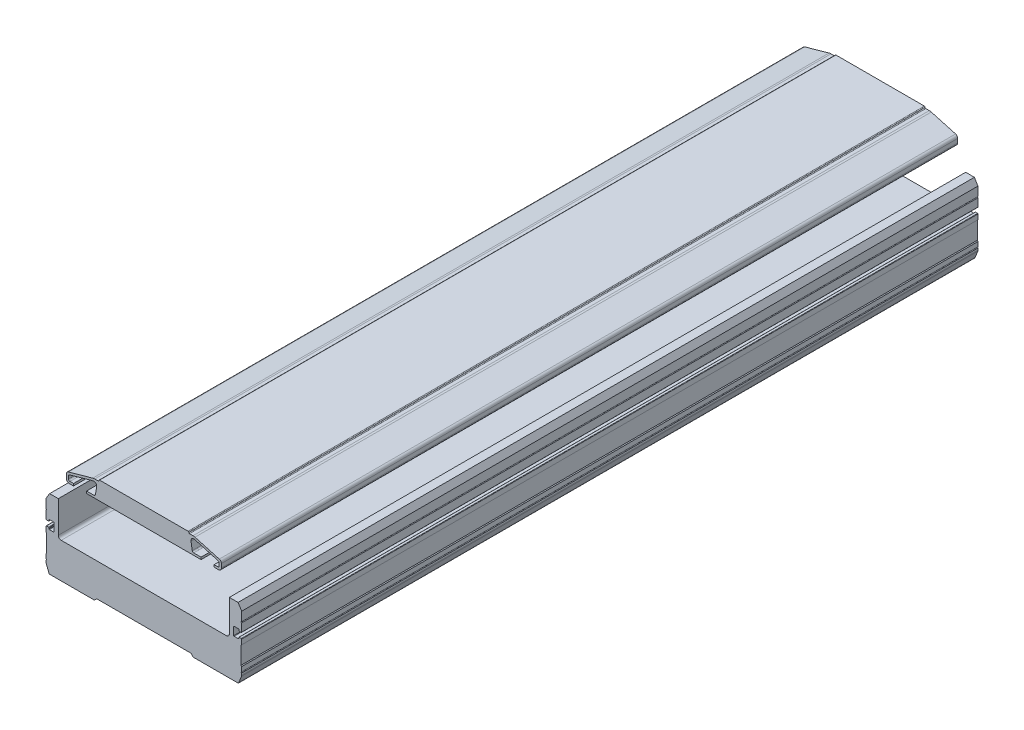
from build123d import *

# Parameters (mm, degrees)
EXTRUDE_1_DEPTH             = 508
EXTRUDE_1_2_DEPTH           = 508
HOLE_WIZARD_1_AT_2_COUNT    = 2
HOLE_WIZARD_1_AT_2_PITCH    = 200
HOLE_WIZARD_1_AT_3_COUNT    = 2
HOLE_WIZARD_1_AT_3_PITCH    = 400
HOLE_WIZARD_1_AT_4_COUNT    = 2
HOLE_WIZARD_1_AT_4_PITCH    = 413.806718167
HOLE_WIZARD_1_AT_5_COUNT    = 2
HOLE_WIZARD_1_AT_5_PITCH    = 226.353705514
HOLE_WIZARD_1_AT_6_COUNT    = 2
HOLE_WIZARD_1_AT_6_PITCH    = 106
HOLE_WIZARD_M6_1_AT_2_COUNT = 2
HOLE_WIZARD_M6_1_AT_2_PITCH = 106
HOLE_WIZARD_M6_1_AT_3_COUNT = 2
HOLE_WIZARD_M6_1_AT_3_PITCH = 200
HOLE_WIZARD_M6_1_AT_4_COUNT = 2
HOLE_WIZARD_M6_1_AT_4_PITCH = 400
HOLE_WIZARD_M6_1_AT_5_COUNT = 2
HOLE_WIZARD_M6_1_AT_5_PITCH = 413.806718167
HOLE_WIZARD_M6_1_AT_6_COUNT = 2
HOLE_WIZARD_M6_1_AT_6_PITCH = 226.353705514


with BuildPart() as part:
    # Sketch 1 → Extrude 1 (new body)
    with BuildSketch(Plane.XY):
        with BuildLine():
            Line((-51.499999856, 59.400000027), (-48.499999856, 59.400000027))
            Line((-48.499999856, 59.400000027), (-48.499999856, 60.900000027))
            Line((-48.499999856, 60.900000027), (-50.999999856, 60.900000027))
            ThreePointArc((-50.999999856, 60.900000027), (-51.707106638, 61.192893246), (-51.999999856, 61.900000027))
            Line((-51.999999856, 61.900000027), (-51.999999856, 63.704621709))
            ThreePointArc((-51.999999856, 63.704621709), (-51.796871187, 64.308770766), (-51.27000769, 64.667479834))
            Line((-51.27000769, 64.667479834), (-35.04852954, 69.21635995))
            ThreePointArc((-35.04852954, 69.21635995), (-33.17193273, 68.778444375), (-32.536146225, 66.959334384))
            Line((-32.536146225, 66.959334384), (-33.413816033, 61.73434537))
            ThreePointArc((-33.413816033, 61.73434537), (-33.754110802, 61.136568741), (-34.399999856, 60.900000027))
            Line((-34.399999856, 60.900000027), (-39.499999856, 60.900000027))
            Line((-39.499999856, 60.900000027), (-39.499999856, 59.400000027))
            Line((-39.499999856, 59.400000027), (39.500000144, 59.400000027))
            Line((39.500000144, 59.400000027), (39.500000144, 60.900000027))
            Line((39.500000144, 60.900000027), (34.400000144, 60.900000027))
            ThreePointArc((34.400000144, 60.900000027), (33.754111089, 61.136568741), (33.41381632, 61.73434537))
            Line((33.41381632, 61.73434537), (32.536146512, 66.959334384))
            ThreePointArc((32.536146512, 66.959334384), (33.171933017, 68.778444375), (35.048529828, 69.21635995))
            Line((35.048529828, 69.21635995), (51.270007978, 64.667479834))
            ThreePointArc((51.270007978, 64.667479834), (51.796871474, 64.308770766), (52.000000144, 63.704621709))
            Line((52.000000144, 63.704621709), (52.000000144, 61.900000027))
            ThreePointArc((52.000000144, 61.900000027), (51.707106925, 61.192893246), (51.000000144, 60.900000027))
            Line((51.000000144, 60.900000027), (48.500000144, 60.900000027))
            Line((48.500000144, 60.900000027), (48.500000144, 59.400000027))
            Line((48.500000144, 59.400000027), (51.500000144, 59.400000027))
            ThreePointArc((51.500000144, 59.400000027), (52.914213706, 59.985786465), (53.500000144, 61.400000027))
            Line((53.500000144, 61.400000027), (53.500000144, 64.083697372))
            ThreePointArc((53.500000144, 64.083697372), (53.093742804, 65.291995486), (52.040015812, 66.009413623))
            Line((52.040015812, 66.009413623), (35.262246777, 70.714290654))
            ThreePointArc((35.262246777, 70.714290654), (34.593583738, 70.853355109), (33.912207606, 70.900000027))
            Line((33.912207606, 70.900000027), (31.500000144, 70.900000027))
            ThreePointArc((31.500000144, 70.900000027), (31.146446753, 71.046446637), (31.000000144, 71.400000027))
            ThreePointArc((31.000000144, 71.400000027), (30.853553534, 71.753553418), (30.500000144, 71.900000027))
            Line((30.500000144, 71.900000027), (-30.499999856, 71.900000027))
            ThreePointArc((-30.499999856, 71.900000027), (-30.853553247, 71.753553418), (-30.999999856, 71.400000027))
            ThreePointArc((-30.999999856, 71.400000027), (-31.146446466, 71.046446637), (-31.499999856, 70.900000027))
            Line((-31.499999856, 70.900000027), (-33.912207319, 70.900000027))
            ThreePointArc((-33.912207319, 70.900000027), (-34.593583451, 70.853355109), (-35.262246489, 70.714290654))
            Line((-35.262246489, 70.714290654), (-52.040015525, 66.009413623))
            ThreePointArc((-52.040015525, 66.009413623), (-53.093742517, 65.291995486), (-53.499999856, 64.083697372))
            Line((-53.499999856, 64.083697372), (-53.499999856, 61.400000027))
            ThreePointArc((-53.499999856, 61.400000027), (-52.914213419, 59.985786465), (-51.499999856, 59.400000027))
        make_face()
    extrude(amount=EXTRUDE_1_DEPTH)


with BuildPart() as body_2:
    # Sketch 1 → Extrude 1 2 (new body)
    with BuildSketch(Plane.XY):
        with BuildLine():
            Line((-65.16, -1.6), (-34.1, -1.6))
            Line((-34.1, -1.6), (-32.5, 0))
            Line((-32.5, 0), (32.5, 0))
            Line((32.5, 0), (34.1, -1.6))
            Line((34.1, -1.6), (65.16, -1.6))
            ThreePointArc((65.16, -1.6), (65.35722349, -1.328991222), (65.506419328, -1.028852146))
            Line((65.506419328, -1.028852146), (67.359978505, 3.646795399))
            ThreePointArc((67.359978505, 3.646795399), (67.464610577, 4.00739535), (67.499999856, 4.381197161))
            Line((67.499999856, 4.381197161), (67.499999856, 5.625000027))
            ThreePointArc((67.499999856, 5.625000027), (67.124999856, 6.000000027), (67.499999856, 6.375000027))
            Line((67.499999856, 6.375000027), (67.499999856, 9.500000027))
            Line((67.499999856, 9.500000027), (66.999999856, 10.000000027))
            Line((66.999999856, 10.000000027), (66.999999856, 22.000000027))
            Line((66.999999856, 22.000000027), (67.499999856, 22.500000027))
            Line((67.499999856, 22.500000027), (67.499999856, 25.900000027))
            ThreePointArc((67.499999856, 25.900000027), (67.412131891, 26.112132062), (67.199999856, 26.200000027))
            Line((67.199999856, 26.200000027), (65.799999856, 26.200000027))
            ThreePointArc((65.799999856, 26.200000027), (65.587867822, 26.112132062), (65.499999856, 25.900000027))
            Line((65.499999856, 25.900000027), (65.499999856, 25.300000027))
            ThreePointArc((65.499999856, 25.300000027), (65.412131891, 25.087867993), (65.199999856, 25.000000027))
            Line((65.199999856, 25.000000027), (62.299999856, 25.000000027))
            ThreePointArc((62.299999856, 25.000000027), (62.087867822, 25.087867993), (61.999999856, 25.300000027))
            Line((61.999999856, 25.300000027), (61.999999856, 30.700000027))
            ThreePointArc((61.999999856, 30.700000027), (62.087867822, 30.912132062), (62.299999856, 31.000000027))
            Line((62.299999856, 31.000000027), (65.199999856, 31.000000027))
            ThreePointArc((65.199999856, 31.000000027), (65.412131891, 30.912132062), (65.499999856, 30.700000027))
            Line((65.499999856, 30.700000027), (65.499999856, 30.100000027))
            ThreePointArc((65.499999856, 30.100000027), (65.587867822, 29.887867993), (65.799999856, 29.800000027))
            Line((65.799999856, 29.800000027), (67.199999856, 29.800000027))
            ThreePointArc((67.199999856, 29.800000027), (67.412131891, 29.887867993), (67.499999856, 30.100000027))
            Line((67.499999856, 30.100000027), (67.499999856, 35.625000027))
            ThreePointArc((67.499999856, 35.625000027), (67.124999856, 36.000000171), (67.500000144, 36.375000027))
            Line((67.500000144, 36.375000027), (67.500000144, 42.600000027))
            Line((67.500000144, 42.600000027), (65.000000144, 46.600000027))
            Line((65.000000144, 46.600000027), (59.000000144, 46.600000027))
            Line((59.000000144, 46.600000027), (59.000000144, 24.700000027))
            ThreePointArc((59.000000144, 24.700000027), (58.414213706, 23.285786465), (57.000000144, 22.700000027))
            Line((57.000000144, 22.700000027), (-56.999999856, 22.700000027))
            ThreePointArc((-56.999999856, 22.700000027), (-58.414213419, 23.285786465), (-58.999999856, 24.700000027))
            Line((-58.999999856, 24.700000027), (-58.999999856, 46.600000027))
            Line((-58.999999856, 46.600000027), (-64.999999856, 46.600000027))
            Line((-64.999999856, 46.600000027), (-67.499999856, 42.600000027))
            Line((-67.499999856, 42.600000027), (-67.499999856, 36.375000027))
            ThreePointArc((-67.499999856, 36.375000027), (-67.124999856, 36.000000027), (-67.499999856, 35.625000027))
            Line((-67.499999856, 35.625000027), (-67.499999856, 30.100000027))
            ThreePointArc((-67.499999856, 30.100000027), (-67.412131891, 29.887867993), (-67.199999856, 29.800000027))
            Line((-67.199999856, 29.800000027), (-65.799999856, 29.800000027))
            ThreePointArc((-65.799999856, 29.800000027), (-65.587867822, 29.887867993), (-65.499999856, 30.100000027))
            Line((-65.499999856, 30.100000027), (-65.499999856, 30.700000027))
            ThreePointArc((-65.499999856, 30.700000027), (-65.412131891, 30.912132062), (-65.199999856, 31.000000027))
            Line((-65.199999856, 31.000000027), (-62.299999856, 31.000000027))
            ThreePointArc((-62.299999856, 31.000000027), (-62.087867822, 30.912132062), (-61.999999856, 30.700000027))
            Line((-61.999999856, 30.700000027), (-61.999999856, 25.300000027))
            ThreePointArc((-61.999999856, 25.300000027), (-62.087867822, 25.087867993), (-62.299999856, 25.000000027))
            Line((-62.299999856, 25.000000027), (-65.199999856, 25.000000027))
            ThreePointArc((-65.199999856, 25.000000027), (-65.412131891, 25.087867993), (-65.499999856, 25.300000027))
            Line((-65.499999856, 25.300000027), (-65.499999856, 25.900000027))
            ThreePointArc((-65.499999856, 25.900000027), (-65.587867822, 26.112132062), (-65.799999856, 26.200000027))
            Line((-65.799999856, 26.200000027), (-67.199999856, 26.200000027))
            ThreePointArc((-67.199999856, 26.200000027), (-67.412131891, 26.112132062), (-67.499999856, 25.900000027))
            Line((-67.499999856, 25.900000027), (-67.499999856, 22.500000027))
            Line((-67.499999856, 22.500000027), (-66.999999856, 22.000000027))
            Line((-66.999999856, 22.000000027), (-66.999999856, 10.000000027))
            Line((-66.999999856, 10.000000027), (-67.499999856, 9.500000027))
            Line((-67.499999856, 9.500000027), (-67.499999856, 6.375000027))
            ThreePointArc((-67.499999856, 6.375000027), (-67.124999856, 6.000000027), (-67.499999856, 5.625000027))
            Line((-67.499999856, 5.625000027), (-67.499999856, 4.381197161))
            ThreePointArc((-67.499999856, 4.381197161), (-67.464610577, 4.00739535), (-67.359978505, 3.646795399))
            Line((-67.359978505, 3.646795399), (-65.506419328, -1.028852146))
            ThreePointArc((-65.506419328, -1.028852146), (-65.35722349, -1.328991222), (-65.16, -1.6))
        make_face()
    extrude(amount=EXTRUDE_1_2_DEPTH)

    # Sketch 5 → Hole Wizard 1 (revolve, cut)
    with BuildSketch(Plane(origin=(-53, 46.600000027, 61.5), x_dir=(0, 0, 1), z_dir=(1, 0, 0))):
        Polygon((0, 0), (0, 48.200000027), (3.5, 48.200000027), (3.5, 40.9), (5.5, 40.9), (5.5, 0), align=None)
    hole_wizard_1 = revolve(axis=Axis((-53, 52.950000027, 61.5), (0, -1, 0)), mode=Mode.SUBTRACT)

    # Hole Wizard 1 at 2: Hole Wizard 1 ×2
    with Locations(*[(0, 0, i * HOLE_WIZARD_1_AT_2_PITCH) for i in range(1, HOLE_WIZARD_1_AT_2_COUNT)]):
        add(hole_wizard_1, mode=Mode.SUBTRACT)

    # Hole Wizard 1 at 3: Hole Wizard 1 ×2
    with Locations(*[(0, 0, i * HOLE_WIZARD_1_AT_3_PITCH) for i in range(1, HOLE_WIZARD_1_AT_3_COUNT)]):
        add(hole_wizard_1, mode=Mode.SUBTRACT)

    # Hole Wizard 1 at 4: Hole Wizard 1 ×2
    with Locations(*[Vector(0.25615823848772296, 4.383941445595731e-14, 0.9666348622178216) * (i * HOLE_WIZARD_1_AT_4_PITCH) for i in range(1, HOLE_WIZARD_1_AT_4_COUNT)]):
        add(hole_wizard_1, mode=Mode.SUBTRACT)

    # Hole Wizard 1 at 5: Hole Wizard 1 ×2
    with Locations(*[Vector(0.4682936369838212, 8.014467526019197e-14, 0.8835728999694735) * (i * HOLE_WIZARD_1_AT_5_PITCH) for i in range(1, HOLE_WIZARD_1_AT_5_COUNT)]):
        add(hole_wizard_1, mode=Mode.SUBTRACT)

    # Hole Wizard 1 at 6: Hole Wizard 1 ×2
    with Locations(*[(i * HOLE_WIZARD_1_AT_6_PITCH, 0, 0) for i in range(1, HOLE_WIZARD_1_AT_6_COUNT)]):
        add(hole_wizard_1, mode=Mode.SUBTRACT)

    # Sketch 9 → Hole Wizard M6 _1 (revolve, cut)
    with BuildSketch(Plane(origin=(53, -1.6, 51.5), x_dir=(0, 0, -1), z_dir=(1, 0, 0))):
        Polygon((0, 0), (0, 12.502151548), (2.5, 11), (2.5, 0), align=None)
    hole_wizard_m6_1 = revolve(axis=Axis((53, -7.95, 51.5), (0, 1, 0)), mode=Mode.SUBTRACT)

    # Hole Wizard M6 _1 at 2: Hole Wizard M6 _1 ×2
    with Locations(*[(-i * HOLE_WIZARD_M6_1_AT_2_PITCH, 0, 0) for i in range(1, HOLE_WIZARD_M6_1_AT_2_COUNT)]):
        add(hole_wizard_m6_1, mode=Mode.SUBTRACT)

    # Hole Wizard M6 _1 at 3: Hole Wizard M6 _1 ×2
    with Locations(*[(0, 0, i * HOLE_WIZARD_M6_1_AT_3_PITCH) for i in range(1, HOLE_WIZARD_M6_1_AT_3_COUNT)]):
        add(hole_wizard_m6_1, mode=Mode.SUBTRACT)

    # Hole Wizard M6 _1 at 4: Hole Wizard M6 _1 ×2
    with Locations(*[(0, 0, i * HOLE_WIZARD_M6_1_AT_4_PITCH) for i in range(1, HOLE_WIZARD_M6_1_AT_4_COUNT)]):
        add(hole_wizard_m6_1, mode=Mode.SUBTRACT)

    # Hole Wizard M6 _1 at 5: Hole Wizard M6 _1 ×2
    with Locations(*[Vector(-0.25615823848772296, 0, 0.9666348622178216) * (i * HOLE_WIZARD_M6_1_AT_5_PITCH) for i in range(1, HOLE_WIZARD_M6_1_AT_5_COUNT)]):
        add(hole_wizard_m6_1, mode=Mode.SUBTRACT)

    # Hole Wizard M6 _1 at 6: Hole Wizard M6 _1 ×2
    with Locations(*[Vector(-0.4682936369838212, 0, 0.8835728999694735) * (i * HOLE_WIZARD_M6_1_AT_6_PITCH) for i in range(1, HOLE_WIZARD_M6_1_AT_6_COUNT)]):
        add(hole_wizard_m6_1, mode=Mode.SUBTRACT)


solid = Compound([part.part, body_2.part])
